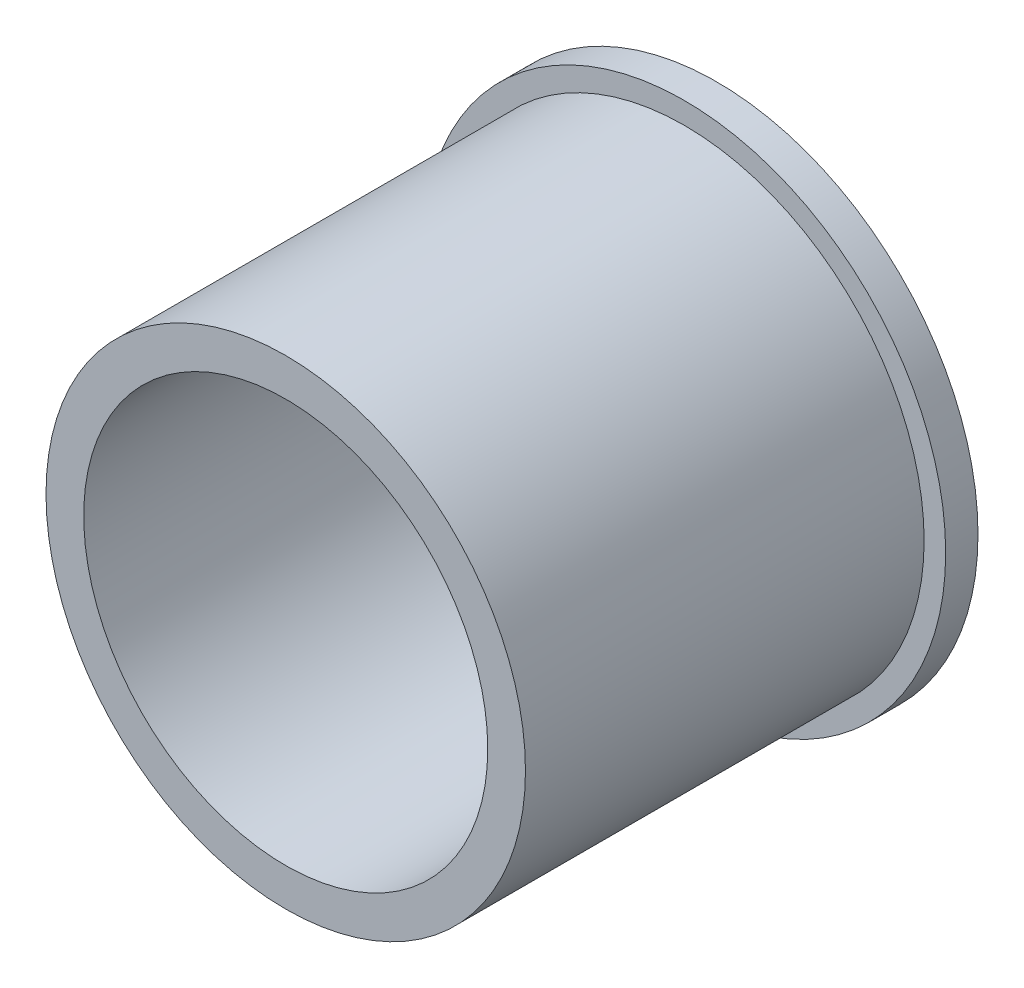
ISO-10303-21;
HEADER;
FILE_DESCRIPTION(('STEP AP214'),'2;1');
FILE_NAME('part.step','',(''),(''),'','','');
FILE_SCHEMA(('AUTOMOTIVE_DESIGN { 1 0 10303 214 1 1 1 1 }'));
ENDSEC;
DATA;
#1=APPLICATION_CONTEXT('core data for automotive mechanical design processes');
#2=APPLICATION_PROTOCOL_DEFINITION('international standard','automotive_design',2000,#1);
#3=PRODUCT_CONTEXT('',#1,'mechanical');
#4=PRODUCT('Part','Part','',(#3));
#5=PRODUCT_RELATED_PRODUCT_CATEGORY('part','',(#4));
#6=PRODUCT_DEFINITION_FORMATION('','',#4);
#7=PRODUCT_DEFINITION_CONTEXT('part definition',#1,'design');
#8=PRODUCT_DEFINITION('design','',#6,#7);
#9=PRODUCT_DEFINITION_SHAPE('','',#8);
#10=(LENGTH_UNIT() NAMED_UNIT(*) SI_UNIT(.MILLI.,.METRE.));
#11=(NAMED_UNIT(*) PLANE_ANGLE_UNIT() SI_UNIT($,.RADIAN.));
#12=(NAMED_UNIT(*) SI_UNIT($,.STERADIAN.) SOLID_ANGLE_UNIT());
#13=UNCERTAINTY_MEASURE_WITH_UNIT(LENGTH_MEASURE(1.E-05),#10,'distance_accuracy_value','');
#14=(GEOMETRIC_REPRESENTATION_CONTEXT(3) GLOBAL_UNCERTAINTY_ASSIGNED_CONTEXT((#13)) GLOBAL_UNIT_ASSIGNED_CONTEXT((#10,
#11,#12)) REPRESENTATION_CONTEXT('',''));
#15=CARTESIAN_POINT('',(0.,0.,0.));
#16=DIRECTION('',(0.,0.,1.));
#17=DIRECTION('',(1.,0.,0.));
#18=AXIS2_PLACEMENT_3D('',#15,#16,#17);
#19=CARTESIAN_POINT('',(0.,0.,5.08));
#20=DIRECTION('',(0.,0.,1.));
#21=DIRECTION('',(1.,0.,0.));
#22=AXIS2_PLACEMENT_3D('',#19,#20,#21);
#23=CYLINDRICAL_SURFACE('',#22,4.7625);
#24=CARTESIAN_POINT('',(0.,0.,-5.07999999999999));
#25=DIRECTION('',(0.,0.,1.));
#26=DIRECTION('',(1.,0.,0.));
#27=AXIS2_PLACEMENT_3D('',#24,#25,#26);
#28=CIRCLE('',#27,4.7625);
#29=CARTESIAN_POINT('',(4.7625,0.,-5.07999999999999));
#30=VERTEX_POINT('',#29);
#31=EDGE_CURVE('E54',#30,#30,#28,.T.);
#32=CARTESIAN_POINT('',(0.,0.,5.08));
#33=DIRECTION('',(0.,0.,1.));
#34=DIRECTION('',(1.,0.,0.));
#35=AXIS2_PLACEMENT_3D('',#32,#33,#34);
#36=CIRCLE('',#35,4.7625);
#37=CARTESIAN_POINT('',(4.7625,0.,5.08));
#38=VERTEX_POINT('',#37);
#39=EDGE_CURVE('E10',#38,#38,#36,.T.);
#40=CARTESIAN_POINT('',(4.7625,0.,-5.07999999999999));
#41=CARTESIAN_POINT('',(4.7625,0.,-4.97416666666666));
#42=CARTESIAN_POINT('',(4.7625,0.,-4.86833333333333));
#43=CARTESIAN_POINT('',(4.7625,0.,-4.65666666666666));
#44=CARTESIAN_POINT('',(4.7625,0.,-4.55083333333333));
#45=CARTESIAN_POINT('',(4.7625,0.,-4.33916666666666));
#46=CARTESIAN_POINT('',(4.7625,0.,-4.23333333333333));
#47=CARTESIAN_POINT('',(4.7625,0.,-4.02166666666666));
#48=CARTESIAN_POINT('',(4.7625,0.,-3.91583333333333));
#49=CARTESIAN_POINT('',(4.7625,0.,-3.70416666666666));
#50=CARTESIAN_POINT('',(4.7625,0.,-3.59833333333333));
#51=CARTESIAN_POINT('',(4.7625,0.,-3.38666666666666));
#52=CARTESIAN_POINT('',(4.7625,0.,-3.28083333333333));
#53=CARTESIAN_POINT('',(4.7625,0.,-3.06916666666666));
#54=CARTESIAN_POINT('',(4.7625,0.,-2.96333333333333));
#55=CARTESIAN_POINT('',(4.7625,0.,-2.75166666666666));
#56=CARTESIAN_POINT('',(4.7625,0.,-2.64583333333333));
#57=CARTESIAN_POINT('',(4.7625,0.,-2.43416666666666));
#58=CARTESIAN_POINT('',(4.7625,0.,-2.32833333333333));
#59=CARTESIAN_POINT('',(4.7625,0.,-2.11666666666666));
#60=CARTESIAN_POINT('',(4.7625,0.,-2.01083333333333));
#61=CARTESIAN_POINT('',(4.7625,0.,-1.79916666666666));
#62=CARTESIAN_POINT('',(4.7625,0.,-1.69333333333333));
#63=CARTESIAN_POINT('',(4.7625,0.,-1.48166666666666));
#64=CARTESIAN_POINT('',(4.7625,0.,-1.37583333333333));
#65=CARTESIAN_POINT('',(4.7625,0.,-1.16416666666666));
#66=CARTESIAN_POINT('',(4.7625,0.,-1.05833333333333));
#67=CARTESIAN_POINT('',(4.7625,0.,-0.846666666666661));
#68=CARTESIAN_POINT('',(4.7625,0.,-0.740833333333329));
#69=CARTESIAN_POINT('',(4.7625,0.,-0.529166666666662));
#70=CARTESIAN_POINT('',(4.7625,0.,-0.423333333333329));
#71=CARTESIAN_POINT('',(4.7625,0.,-0.211666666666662));
#72=CARTESIAN_POINT('',(4.7625,0.,-0.105833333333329));
#73=CARTESIAN_POINT('',(4.7625,0.,0.105833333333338));
#74=CARTESIAN_POINT('',(4.7625,0.,0.211666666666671));
#75=CARTESIAN_POINT('',(4.7625,0.,0.423333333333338));
#76=CARTESIAN_POINT('',(4.7625,0.,0.529166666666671));
#77=CARTESIAN_POINT('',(4.7625,0.,0.740833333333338));
#78=CARTESIAN_POINT('',(4.7625,0.,0.846666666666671));
#79=CARTESIAN_POINT('',(4.7625,0.,1.05833333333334));
#80=CARTESIAN_POINT('',(4.7625,0.,1.16416666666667));
#81=CARTESIAN_POINT('',(4.7625,0.,1.37583333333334));
#82=CARTESIAN_POINT('',(4.7625,0.,1.48166666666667));
#83=CARTESIAN_POINT('',(4.7625,0.,1.69333333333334));
#84=CARTESIAN_POINT('',(4.7625,0.,1.79916666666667));
#85=CARTESIAN_POINT('',(4.7625,0.,2.01083333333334));
#86=CARTESIAN_POINT('',(4.7625,0.,2.11666666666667));
#87=CARTESIAN_POINT('',(4.7625,0.,2.32833333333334));
#88=CARTESIAN_POINT('',(4.7625,0.,2.43416666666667));
#89=CARTESIAN_POINT('',(4.7625,0.,2.64583333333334));
#90=CARTESIAN_POINT('',(4.7625,0.,2.75166666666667));
#91=CARTESIAN_POINT('',(4.7625,0.,2.96333333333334));
#92=CARTESIAN_POINT('',(4.7625,0.,3.06916666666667));
#93=CARTESIAN_POINT('',(4.7625,0.,3.28083333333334));
#94=CARTESIAN_POINT('',(4.7625,0.,3.38666666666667));
#95=CARTESIAN_POINT('',(4.7625,0.,3.59833333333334));
#96=CARTESIAN_POINT('',(4.7625,0.,3.70416666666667));
#97=CARTESIAN_POINT('',(4.7625,0.,3.91583333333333));
#98=CARTESIAN_POINT('',(4.7625,0.,4.02166666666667));
#99=CARTESIAN_POINT('',(4.7625,0.,4.23333333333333));
#100=CARTESIAN_POINT('',(4.7625,0.,4.33916666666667));
#101=CARTESIAN_POINT('',(4.7625,0.,4.55083333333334));
#102=CARTESIAN_POINT('',(4.7625,0.,4.65666666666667));
#103=CARTESIAN_POINT('',(4.7625,0.,4.86833333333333));
#104=CARTESIAN_POINT('',(4.7625,0.,4.97416666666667));
#105=CARTESIAN_POINT('',(4.7625,0.,5.08));
#106=B_SPLINE_CURVE_WITH_KNOTS('',3,(#40,#41,#42,#43,#44,#45,#46,#47,#48,#49,#50,#51,#52,#53,
#54,#55,#56,#57,#58,#59,#60,#61,#62,#63,#64,#65,#66,#67,#68,#69,#70,#71,#72,#73,#74,#75,#76,#77,
#78,#79,#80,#81,#82,#83,#84,#85,#86,#87,#88,#89,#90,#91,#92,#93,#94,#95,#96,#97,#98,#99,#100,
#101,#102,#103,#104,#105),.UNSPECIFIED.,.F.,.F.,(4,2,2,2,2,2,2,2,2,2,2,2,2,2,2,2,2,2,2,2,2,2,2,
2,2,2,2,2,2,2,2,2,4),(0.,0.3175,0.635,0.9525,1.27,1.5875,1.905,2.2225,2.54,2.8575,3.175,3.4925,
3.81,4.1275,4.445,4.7625,5.08,5.3975,5.715,6.0325,6.35,6.6675,6.985,7.30249999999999,
7.61999999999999,7.93749999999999,8.255,8.57249999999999,8.88999999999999,9.20749999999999,
9.52499999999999,9.84249999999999,10.16),.UNSPECIFIED.);
#107=EDGE_CURVE('BSEAM32',#30,#38,#106,.T.);
#108=ORIENTED_EDGE('',*,*,#31,.F.);
#109=ORIENTED_EDGE('',*,*,#39,.T.);
#110=ORIENTED_EDGE('',*,*,#107,.T.);
#111=ORIENTED_EDGE('',*,*,#107,.F.);
#112=EDGE_LOOP('',(#108,#110,#109,#111));
#113=FACE_BOUND('',#112,.T.);
#114=ADVANCED_FACE('F32',(#113),#23,.F.);
#115=CARTESIAN_POINT('',(-4.7625,0.,5.08));
#116=DIRECTION('',(0.,0.,-1.));
#117=DIRECTION('',(-1.,0.,0.));
#118=AXIS2_PLACEMENT_3D('',#115,#116,#117);
#119=PLANE('',#118);
#120=ORIENTED_EDGE('',*,*,#39,.F.);
#121=EDGE_LOOP('',(#120));
#122=FACE_BOUND('',#121,.T.);
#123=CARTESIAN_POINT('',(0.,0.,5.08));
#124=DIRECTION('',(0.,0.,1.));
#125=DIRECTION('',(1.,0.,0.));
#126=AXIS2_PLACEMENT_3D('',#123,#124,#125);
#127=CIRCLE('',#126,5.6515);
#128=CARTESIAN_POINT('',(5.6515,0.,5.08));
#129=VERTEX_POINT('',#128);
#130=EDGE_CURVE('E38',#129,#129,#127,.T.);
#131=ORIENTED_EDGE('',*,*,#130,.T.);
#132=EDGE_LOOP('',(#131));
#133=FACE_BOUND('',#132,.T.);
#134=ADVANCED_FACE('F61',(#122,#133),#119,.F.);
#135=CARTESIAN_POINT('',(0.,0.,5.08));
#136=DIRECTION('',(0.,0.,1.));
#137=DIRECTION('',(1.,0.,0.));
#138=AXIS2_PLACEMENT_3D('',#135,#136,#137);
#139=CYLINDRICAL_SURFACE('',#138,5.6515);
#140=CARTESIAN_POINT('',(0.,0.,-4.318));
#141=DIRECTION('',(0.,0.,1.));
#142=DIRECTION('',(1.,0.,0.));
#143=AXIS2_PLACEMENT_3D('',#140,#141,#142);
#144=CIRCLE('',#143,5.6515);
#145=CARTESIAN_POINT('',(5.6515,0.,-4.31799999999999));
#146=VERTEX_POINT('',#145);
#147=EDGE_CURVE('E42',#146,#146,#144,.T.);
#148=CARTESIAN_POINT('',(5.6515,0.,5.08));
#149=CARTESIAN_POINT('',(5.6515,0.,4.98210416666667));
#150=CARTESIAN_POINT('',(5.6515,0.,4.88420833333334));
#151=CARTESIAN_POINT('',(5.6515,0.,4.68841666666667));
#152=CARTESIAN_POINT('',(5.6515,0.,4.59052083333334));
#153=CARTESIAN_POINT('',(5.6515,0.,4.39472916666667));
#154=CARTESIAN_POINT('',(5.6515,0.,4.29683333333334));
#155=CARTESIAN_POINT('',(5.6515,0.,4.10104166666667));
#156=CARTESIAN_POINT('',(5.6515,0.,4.00314583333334));
#157=CARTESIAN_POINT('',(5.6515,0.,3.80735416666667));
#158=CARTESIAN_POINT('',(5.6515,0.,3.70945833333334));
#159=CARTESIAN_POINT('',(5.6515,0.,3.51366666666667));
#160=CARTESIAN_POINT('',(5.6515,0.,3.41577083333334));
#161=CARTESIAN_POINT('',(5.6515,0.,3.21997916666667));
#162=CARTESIAN_POINT('',(5.6515,0.,3.12208333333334));
#163=CARTESIAN_POINT('',(5.6515,0.,2.92629166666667));
#164=CARTESIAN_POINT('',(5.6515,0.,2.82839583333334));
#165=CARTESIAN_POINT('',(5.6515,0.,2.63260416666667));
#166=CARTESIAN_POINT('',(5.6515,0.,2.53470833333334));
#167=CARTESIAN_POINT('',(5.6515,0.,2.33891666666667));
#168=CARTESIAN_POINT('',(5.6515,0.,2.24102083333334));
#169=CARTESIAN_POINT('',(5.6515,0.,2.04522916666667));
#170=CARTESIAN_POINT('',(5.6515,0.,1.94733333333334));
#171=CARTESIAN_POINT('',(5.6515,0.,1.75154166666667));
#172=CARTESIAN_POINT('',(5.6515,0.,1.65364583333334));
#173=CARTESIAN_POINT('',(5.6515,0.,1.45785416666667));
#174=CARTESIAN_POINT('',(5.6515,0.,1.35995833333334));
#175=CARTESIAN_POINT('',(5.6515,0.,1.16416666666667));
#176=CARTESIAN_POINT('',(5.6515,0.,1.06627083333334));
#177=CARTESIAN_POINT('',(5.6515,0.,0.870479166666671));
#178=CARTESIAN_POINT('',(5.6515,0.,0.772583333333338));
#179=CARTESIAN_POINT('',(5.6515,0.,0.576791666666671));
#180=CARTESIAN_POINT('',(5.6515,0.,0.478895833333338));
#181=CARTESIAN_POINT('',(5.6515,0.,0.283104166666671));
#182=CARTESIAN_POINT('',(5.6515,0.,0.185208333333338));
#183=CARTESIAN_POINT('',(5.6515,0.,-0.0105833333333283));
#184=CARTESIAN_POINT('',(5.6515,0.,-0.108479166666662));
#185=CARTESIAN_POINT('',(5.6515,0.,-0.304270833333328));
#186=CARTESIAN_POINT('',(5.6515,0.,-0.402166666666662));
#187=CARTESIAN_POINT('',(5.6515,0.,-0.597958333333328));
#188=CARTESIAN_POINT('',(5.6515,0.,-0.695854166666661));
#189=CARTESIAN_POINT('',(5.6515,0.,-0.891645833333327));
#190=CARTESIAN_POINT('',(5.6515,0.,-0.989541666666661));
#191=CARTESIAN_POINT('',(5.6515,0.,-1.18533333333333));
#192=CARTESIAN_POINT('',(5.6515,0.,-1.28322916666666));
#193=CARTESIAN_POINT('',(5.6515,0.,-1.47902083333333));
#194=CARTESIAN_POINT('',(5.6515,0.,-1.57691666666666));
#195=CARTESIAN_POINT('',(5.6515,0.,-1.77270833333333));
#196=CARTESIAN_POINT('',(5.6515,0.,-1.87060416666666));
#197=CARTESIAN_POINT('',(5.6515,0.,-2.06639583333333));
#198=CARTESIAN_POINT('',(5.6515,0.,-2.16429166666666));
#199=CARTESIAN_POINT('',(5.6515,0.,-2.36008333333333));
#200=CARTESIAN_POINT('',(5.6515,0.,-2.45797916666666));
#201=CARTESIAN_POINT('',(5.6515,0.,-2.65377083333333));
#202=CARTESIAN_POINT('',(5.6515,0.,-2.75166666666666));
#203=CARTESIAN_POINT('',(5.6515,0.,-2.94745833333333));
#204=CARTESIAN_POINT('',(5.6515,0.,-3.04535416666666));
#205=CARTESIAN_POINT('',(5.6515,0.,-3.24114583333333));
#206=CARTESIAN_POINT('',(5.6515,0.,-3.33904166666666));
#207=CARTESIAN_POINT('',(5.6515,0.,-3.53483333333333));
#208=CARTESIAN_POINT('',(5.6515,0.,-3.63272916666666));
#209=CARTESIAN_POINT('',(5.6515,0.,-3.82852083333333));
#210=CARTESIAN_POINT('',(5.6515,0.,-3.92641666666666));
#211=CARTESIAN_POINT('',(5.6515,0.,-4.12220833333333));
#212=CARTESIAN_POINT('',(5.6515,0.,-4.22010416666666));
#213=CARTESIAN_POINT('',(5.6515,0.,-4.31799999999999));
#214=B_SPLINE_CURVE_WITH_KNOTS('',3,(#148,#149,#150,#151,#152,#153,#154,#155,#156,#157,#158,
#159,#160,#161,#162,#163,#164,#165,#166,#167,#168,#169,#170,#171,#172,#173,#174,#175,#176,#177,
#178,#179,#180,#181,#182,#183,#184,#185,#186,#187,#188,#189,#190,#191,#192,#193,#194,#195,#196,
#197,#198,#199,#200,#201,#202,#203,#204,#205,#206,#207,#208,#209,#210,#211,#212,#213),
.UNSPECIFIED.,.F.,.F.,(4,2,2,2,2,2,2,2,2,2,2,2,2,2,2,2,2,2,2,2,2,2,2,2,2,2,2,2,2,2,2,2,4),(0.,
0.293687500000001,0.587375,0.8810625,1.17475,1.4684375,1.762125,2.0558125,2.3495,2.6431875,
2.936875,3.2305625,3.52425,3.8179375,4.111625,4.4053125,4.699,4.9926875,5.286375,5.5800625,
5.87375,6.1674375,6.461125,6.7548125,7.0485,7.3421875,7.635875,7.9295625,8.22325,8.5169375,
8.810625,9.1043125,9.398),.UNSPECIFIED.);
#215=EDGE_CURVE('BSEAM65',#129,#146,#214,.T.);
#216=ORIENTED_EDGE('',*,*,#130,.F.);
#217=ORIENTED_EDGE('',*,*,#147,.T.);
#218=ORIENTED_EDGE('',*,*,#215,.T.);
#219=ORIENTED_EDGE('',*,*,#215,.F.);
#220=EDGE_LOOP('',(#216,#218,#217,#219));
#221=FACE_BOUND('',#220,.T.);
#222=ADVANCED_FACE('F65',(#221),#139,.T.);
#223=CARTESIAN_POINT('',(-5.6515,0.,-4.318));
#224=DIRECTION('',(0.,0.,-1.));
#225=DIRECTION('',(-1.,0.,0.));
#226=AXIS2_PLACEMENT_3D('',#223,#224,#225);
#227=PLANE('',#226);
#228=ORIENTED_EDGE('',*,*,#147,.F.);
#229=EDGE_LOOP('',(#228));
#230=FACE_BOUND('',#229,.T.);
#231=CARTESIAN_POINT('',(0.,0.,-4.318));
#232=DIRECTION('',(0.,0.,1.));
#233=DIRECTION('',(1.,0.,0.));
#234=AXIS2_PLACEMENT_3D('',#231,#232,#233);
#235=CIRCLE('',#234,6.1595);
#236=CARTESIAN_POINT('',(6.1595,0.,-4.31799999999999));
#237=VERTEX_POINT('',#236);
#238=EDGE_CURVE('E46',#237,#237,#235,.T.);
#239=ORIENTED_EDGE('',*,*,#238,.T.);
#240=EDGE_LOOP('',(#239));
#241=FACE_BOUND('',#240,.T.);
#242=ADVANCED_FACE('F70',(#230,#241),#227,.F.);
#243=CARTESIAN_POINT('',(0.,0.,5.08));
#244=DIRECTION('',(0.,0.,1.));
#245=DIRECTION('',(1.,0.,0.));
#246=AXIS2_PLACEMENT_3D('',#243,#244,#245);
#247=CYLINDRICAL_SURFACE('',#246,6.1595);
#248=CARTESIAN_POINT('',(0.,0.,-5.07999999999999));
#249=DIRECTION('',(0.,0.,1.));
#250=DIRECTION('',(1.,0.,0.));
#251=AXIS2_PLACEMENT_3D('',#248,#249,#250);
#252=CIRCLE('',#251,6.1595);
#253=CARTESIAN_POINT('',(6.1595,0.,-5.07999999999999));
#254=VERTEX_POINT('',#253);
#255=EDGE_CURVE('E51',#254,#254,#252,.T.);
#256=CARTESIAN_POINT('',(6.1595,0.,-4.31799999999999));
#257=CARTESIAN_POINT('',(6.1595,0.,-4.32593749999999));
#258=CARTESIAN_POINT('',(6.1595,0.,-4.33387499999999));
#259=CARTESIAN_POINT('',(6.1595,0.,-4.34974999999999));
#260=CARTESIAN_POINT('',(6.1595,0.,-4.35768749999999));
#261=CARTESIAN_POINT('',(6.1595,0.,-4.37356249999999));
#262=CARTESIAN_POINT('',(6.1595,0.,-4.38149999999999));
#263=CARTESIAN_POINT('',(6.1595,0.,-4.39737499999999));
#264=CARTESIAN_POINT('',(6.1595,0.,-4.40531249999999));
#265=CARTESIAN_POINT('',(6.1595,0.,-4.42118749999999));
#266=CARTESIAN_POINT('',(6.1595,0.,-4.42912499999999));
#267=CARTESIAN_POINT('',(6.1595,0.,-4.44499999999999));
#268=CARTESIAN_POINT('',(6.1595,0.,-4.45293749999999));
#269=CARTESIAN_POINT('',(6.1595,0.,-4.46881249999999));
#270=CARTESIAN_POINT('',(6.1595,0.,-4.47674999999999));
#271=CARTESIAN_POINT('',(6.1595,0.,-4.49262499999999));
#272=CARTESIAN_POINT('',(6.1595,0.,-4.50056249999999));
#273=CARTESIAN_POINT('',(6.1595,0.,-4.51643749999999));
#274=CARTESIAN_POINT('',(6.1595,0.,-4.52437499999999));
#275=CARTESIAN_POINT('',(6.1595,0.,-4.54024999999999));
#276=CARTESIAN_POINT('',(6.1595,0.,-4.54818749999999));
#277=CARTESIAN_POINT('',(6.1595,0.,-4.56406249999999));
#278=CARTESIAN_POINT('',(6.1595,0.,-4.57199999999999));
#279=CARTESIAN_POINT('',(6.1595,0.,-4.58787499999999));
#280=CARTESIAN_POINT('',(6.1595,0.,-4.59581249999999));
#281=CARTESIAN_POINT('',(6.1595,0.,-4.61168749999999));
#282=CARTESIAN_POINT('',(6.1595,0.,-4.61962499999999));
#283=CARTESIAN_POINT('',(6.1595,0.,-4.63549999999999));
#284=CARTESIAN_POINT('',(6.1595,0.,-4.64343749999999));
#285=CARTESIAN_POINT('',(6.1595,0.,-4.65931249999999));
#286=CARTESIAN_POINT('',(6.1595,0.,-4.66724999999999));
#287=CARTESIAN_POINT('',(6.1595,0.,-4.68312499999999));
#288=CARTESIAN_POINT('',(6.1595,0.,-4.69106249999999));
#289=CARTESIAN_POINT('',(6.1595,0.,-4.70693749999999));
#290=CARTESIAN_POINT('',(6.1595,0.,-4.71487499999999));
#291=CARTESIAN_POINT('',(6.1595,0.,-4.73074999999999));
#292=CARTESIAN_POINT('',(6.1595,0.,-4.73868749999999));
#293=CARTESIAN_POINT('',(6.1595,0.,-4.75456249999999));
#294=CARTESIAN_POINT('',(6.1595,0.,-4.76249999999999));
#295=CARTESIAN_POINT('',(6.1595,0.,-4.77837499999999));
#296=CARTESIAN_POINT('',(6.1595,0.,-4.78631249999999));
#297=CARTESIAN_POINT('',(6.1595,0.,-4.80218749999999));
#298=CARTESIAN_POINT('',(6.1595,0.,-4.81012499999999));
#299=CARTESIAN_POINT('',(6.1595,0.,-4.82599999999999));
#300=CARTESIAN_POINT('',(6.1595,0.,-4.83393749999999));
#301=CARTESIAN_POINT('',(6.1595,0.,-4.84981249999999));
#302=CARTESIAN_POINT('',(6.1595,0.,-4.85774999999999));
#303=CARTESIAN_POINT('',(6.1595,0.,-4.87362499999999));
#304=CARTESIAN_POINT('',(6.1595,0.,-4.88156249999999));
#305=CARTESIAN_POINT('',(6.1595,0.,-4.89743749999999));
#306=CARTESIAN_POINT('',(6.1595,0.,-4.90537499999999));
#307=CARTESIAN_POINT('',(6.1595,0.,-4.92124999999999));
#308=CARTESIAN_POINT('',(6.1595,0.,-4.92918749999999));
#309=CARTESIAN_POINT('',(6.1595,0.,-4.94506249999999));
#310=CARTESIAN_POINT('',(6.1595,0.,-4.95299999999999));
#311=CARTESIAN_POINT('',(6.1595,0.,-4.96887499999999));
#312=CARTESIAN_POINT('',(6.1595,0.,-4.97681249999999));
#313=CARTESIAN_POINT('',(6.1595,0.,-4.99268749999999));
#314=CARTESIAN_POINT('',(6.1595,0.,-5.00062499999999));
#315=CARTESIAN_POINT('',(6.1595,0.,-5.01649999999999));
#316=CARTESIAN_POINT('',(6.1595,0.,-5.02443749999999));
#317=CARTESIAN_POINT('',(6.1595,0.,-5.04031249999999));
#318=CARTESIAN_POINT('',(6.1595,0.,-5.04824999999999));
#319=CARTESIAN_POINT('',(6.1595,0.,-5.06412499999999));
#320=CARTESIAN_POINT('',(6.1595,0.,-5.07206249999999));
#321=CARTESIAN_POINT('',(6.1595,0.,-5.07999999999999));
#322=B_SPLINE_CURVE_WITH_KNOTS('',3,(#256,#257,#258,#259,#260,#261,#262,#263,#264,#265,#266,
#267,#268,#269,#270,#271,#272,#273,#274,#275,#276,#277,#278,#279,#280,#281,#282,#283,#284,#285,
#286,#287,#288,#289,#290,#291,#292,#293,#294,#295,#296,#297,#298,#299,#300,#301,#302,#303,#304,
#305,#306,#307,#308,#309,#310,#311,#312,#313,#314,#315,#316,#317,#318,#319,#320,#321),
.UNSPECIFIED.,.F.,.F.,(4,2,2,2,2,2,2,2,2,2,2,2,2,2,2,2,2,2,2,2,2,2,2,2,2,2,2,2,2,2,2,2,4),(0.,
0.0238124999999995,0.0476249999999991,0.0714375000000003,0.0952499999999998,0.119062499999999,
0.142875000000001,0.1666875,0.1905,0.214312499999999,0.238124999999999,0.2619375,0.28575,
0.309562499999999,0.333375,0.3571875,0.380999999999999,0.404812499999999,0.428624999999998,
0.4524375,0.476249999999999,0.500062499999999,0.523875,0.5476875,0.571499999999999,
0.595312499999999,0.619124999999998,0.642937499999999,0.666749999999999,0.690562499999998,
0.714375,0.738187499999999,0.761999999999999),.UNSPECIFIED.);
#323=EDGE_CURVE('BSEAM76',#237,#254,#322,.T.);
#324=ORIENTED_EDGE('',*,*,#238,.F.);
#325=ORIENTED_EDGE('',*,*,#255,.T.);
#326=ORIENTED_EDGE('',*,*,#323,.T.);
#327=ORIENTED_EDGE('',*,*,#323,.F.);
#328=EDGE_LOOP('',(#324,#326,#325,#327));
#329=FACE_BOUND('',#328,.T.);
#330=ADVANCED_FACE('F76',(#329),#247,.T.);
#331=CARTESIAN_POINT('',(-6.1595,0.,-5.07999999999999));
#332=DIRECTION('',(0.,0.,1.));
#333=DIRECTION('',(1.,0.,0.));
#334=AXIS2_PLACEMENT_3D('',#331,#332,#333);
#335=PLANE('',#334);
#336=ORIENTED_EDGE('',*,*,#255,.F.);
#337=EDGE_LOOP('',(#336));
#338=FACE_BOUND('',#337,.T.);
#339=ORIENTED_EDGE('',*,*,#31,.T.);
#340=EDGE_LOOP('',(#339));
#341=FACE_BOUND('',#340,.T.);
#342=ADVANCED_FACE('F58',(#338,#341),#335,.F.);
#343=CLOSED_SHELL('',(#114,#134,#222,#242,#330,#342));
#344=MANIFOLD_SOLID_BREP('B2',#343);
#345=ADVANCED_BREP_SHAPE_REPRESENTATION('',(#18,#344),#14);
#346=SHAPE_DEFINITION_REPRESENTATION(#9,#345);
ENDSEC;
END-ISO-10303-21;
